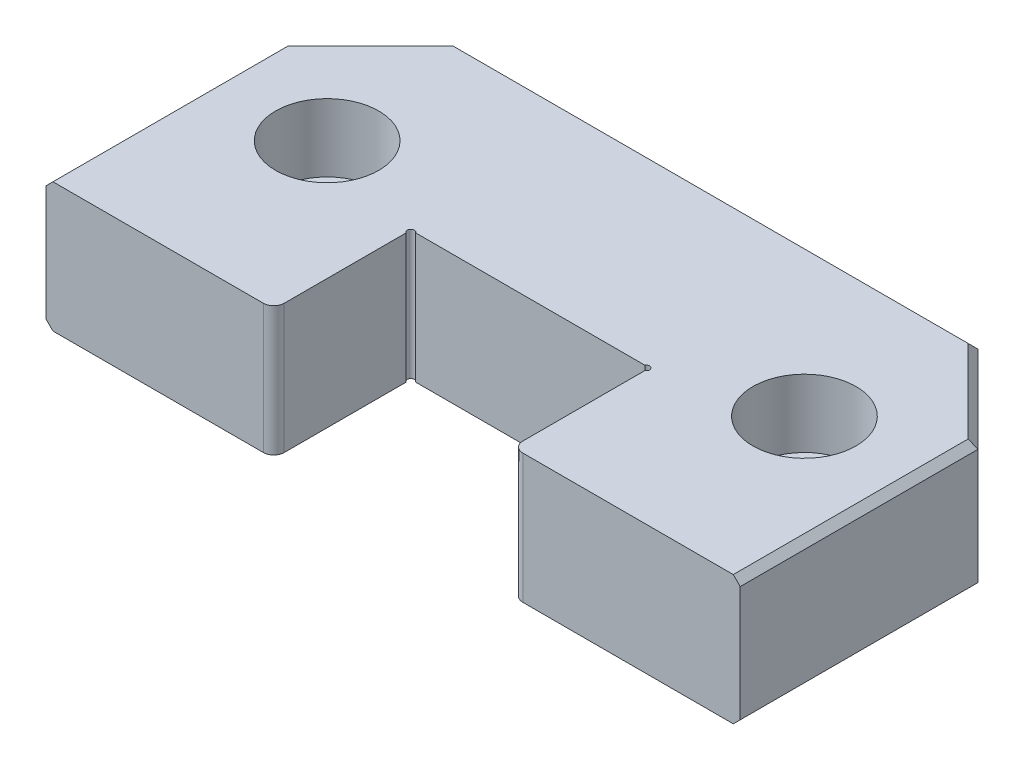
from build123d import *

# Parameters (mm, degrees)
SKETCH2_W               = 101.6
SKETCH2_H               = 47.498
EXTRUDE1_DEPTH          = 18.923
CHAMFER1_SIZE           = 12.7
CUT_EXTRUDE1_DEPTH      = 22.86
CUT_EXTRUDE1_DEPTH_BACK = 73.074821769
FILLET1_R               = 1.524
SKETCH4_R               = 5.1562
CUT_EXTRUDE2_DEPTH      = 15.748
CUT_EXTRUDE3_START      = -18.923
SKETCH5_R               = 7.5438
CUT_EXTRUDE3_DEPTH      = 9.9314
CHAMFER2_SIZE           = 1.016


with BuildPart() as part:
    # Sketch2 → Extrude1 (new body)
    with BuildSketch(Plane(origin=(0, 0, 0), x_dir=(1, 0, 0), z_dir=(0, 1, 0))):
        with Locations((0, 23.749)):
            Rectangle(SKETCH2_W, SKETCH2_H)
    extrude(amount=EXTRUDE1_DEPTH)

    # Chamfer1
    chamfer1_edges = [part.edges().sort_by_distance(p)[0] for p in [
        (-50.8, 9.4615, -47.498),
        (50.8, 9.4615, -47.498),
    ]]
    chamfer(chamfer1_edges, length=CHAMFER1_SIZE)

    # Sketch3 → Cut-Extrude1 (cut, two sides: drawn at the far end of the back side and taken through both)
    with BuildSketch(Plane.XZ.offset(-CUT_EXTRUDE1_DEPTH_BACK)):
        with BuildLine():
            Line((-16.768559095, -20.066), (16.768559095, -20.066))
            ThreePointArc((16.768559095, -20.066), (17.567710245, -20.171210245), (17.4625, -19.372059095))
            Line((17.4625, -19.372059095), (17.4625, 1.558776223))
            Line((17.4625, 1.558776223), (-17.4625, 1.558776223))
            Line((-17.4625, 1.558776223), (-17.4625, -19.372059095))
            ThreePointArc((-17.4625, -19.372059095), (-17.567710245, -20.171210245), (-16.768559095, -20.066))
        make_face()
    extrude(amount=CUT_EXTRUDE1_DEPTH + CUT_EXTRUDE1_DEPTH_BACK, mode=Mode.SUBTRACT)

    # Fillet1
    fillet1_edges = [part.edges().sort_by_distance(p)[0] for p in [
        (17.4625, 9.4615, 0),
        (-17.4625, 9.4615, 0),
    ]]
    fillet(fillet1_edges, radius=FILLET1_R)

    # Sketch4 → Cut-Extrude2 (cut)
    with BuildSketch(Plane.XZ):
        with Locations(Location((34.925, -25.273, 0), (0, 0, 270))):
            Circle(SKETCH4_R)
        with Locations(Location((-34.925, -25.273, 0), (0, 0, 270))):
            Circle(SKETCH4_R)
    extrude(amount=-CUT_EXTRUDE2_DEPTH, mode=Mode.SUBTRACT)

    # Sketch5 → Cut-Extrude3 (cut)
    with BuildSketch(Plane.XZ.offset(CUT_EXTRUDE3_START)):
        with Locations(Location((34.925, -25.273, 0), (0, 0, 90))):
            Circle(SKETCH5_R)
        with Locations(Location((-34.925, -25.273, 0), (0, 0, 90))):
            Circle(SKETCH5_R)
    extrude(amount=CUT_EXTRUDE3_DEPTH, mode=Mode.SUBTRACT)

    # Chamfer2
    chamfer2_edges = [part.edges().sort_by_distance(p)[0] for p in [
        (50.8, 18.923, -17.399),
        (0, 0, -47.498),
        (0, 18.923, -47.498),
        (-50.8, 0, -17.399),
        (-44.45, 0, -41.148),
        (44.45, 0, -41.148),
        (-50.8, 18.923, -17.399),
        (-44.45, 18.923, -41.148),
        (44.45, 18.923, -41.148),
        (50.8, 0, -17.399),
    ]]
    chamfer(chamfer2_edges, length=CHAMFER2_SIZE)


solid = part.part
